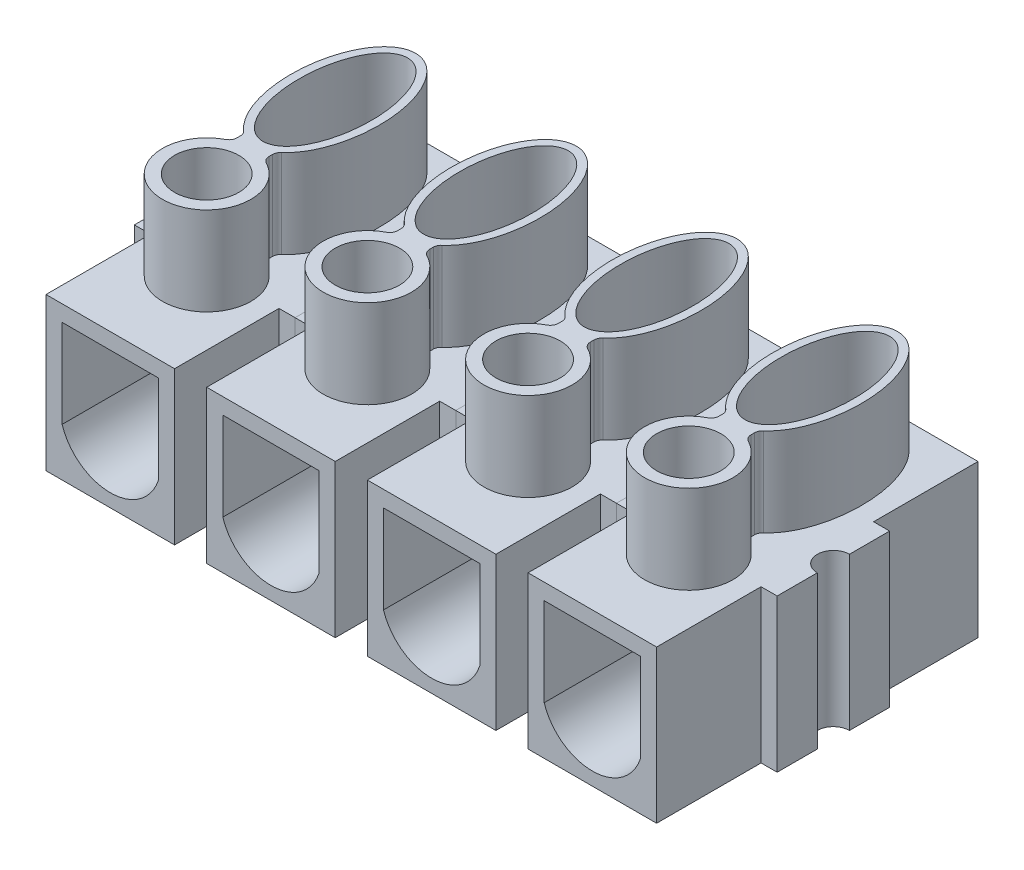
from build123d import *

# Parameters (mm, degrees)
ESQUISSE1_W                = 8
ESQUISSE1_H                = 9.5
EXTRUSION1_DEPTH           = 10
ESQUISSE2_W                = 7
ESQUISSE2_H                = 9.5
EXTRUSION2_DEPTH           = 1
ENL_V_MAT_EXTRU_1_DEPTH    = 15.671400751
ESQUISSE4_R                = 2
ENL_V_MAT_EXTRU_2_DEPTH    = 3
EXTRUSION3_START           = 5.5
ESQUISSE5_R                = 2.75
ESQUISSE5_R_2              = 2
EXTRUSION3_DEPTH           = 5.5
ESQUISSE6_RX               = 5
ESQUISSE6_RY               = 2.75
ESQUISSE6_RX_2             = 4.5
ESQUISSE6_RY_2             = 2.25
EXTRUSION4_DEPTH           = 5.5
EXTRUSION5_START           = 0.5
ESQUISSE7_W                = 2
ESQUISSE7_H                = 5.5
EXTRUSION5_DEPTH           = 1
CONG_1_R                   = 0.5
R_P_TITION_LIN_AIRE3_COUNT = 4
R_P_TITION_LIN_AIRE3_PITCH = 10


with BuildPart() as part:
    # Esquisse1 → Extrusion1 (new, symmetric)
    with BuildSketch(Plane.XY):
        with Locations((0, -4.75)):
            Rectangle(ESQUISSE1_W, ESQUISSE1_H)
        with BuildLine():
            Line((-2.997406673, -1), (3, -1))
            Line((3, -1), (3, -6.5))
            ThreePointArc((3, -6.5), (0.001296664, -8.685490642), (-2.997406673, -6.5))
            Line((-2.997406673, -6.5), (-2.997406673, -1))
        make_face(mode=Mode.SUBTRACT)
    extrude(amount=EXTRUSION1_DEPTH, both=True)

    # Esquisse2 → Extrusion2 (add)
    with BuildSketch(Plane(origin=(4, 0, 0), x_dir=(0, 0, -1), z_dir=(1, 0, 0))):
        with Locations((0, -4.75)):
            Rectangle(ESQUISSE2_W, ESQUISSE2_H)
    extrusion2 = extrude(amount=EXTRUSION2_DEPTH)

    # Sym_trie1: Extrusion2 across plane
    add(extrusion2.mirror(Plane(origin=(0, 0, 0), x_dir=(0, 0, 1), z_dir=(1, 0, 0))))

    # Esquisse3 → Enl_v. mat.-Extru.1 (cut, through all)
    with BuildSketch(Plane(origin=(0, 0, 0), x_dir=(-1, 0, 0), z_dir=(0, 1, 0))):
        with BuildLine():
            Line((-5, 1), (-5, -1))
            ThreePointArc((-5, -1), (-4, 0), (-5, 1))
        make_face()
        with BuildLine():
            Line((5, 1), (5, -1))
            ThreePointArc((5, -1), (4, 0), (5, 1))
        make_face()
    extrude(amount=-ENL_V_MAT_EXTRU_1_DEPTH, mode=Mode.SUBTRACT)

    # Esquisse4 → Enl_v. mat.-Extru.2 (cut)
    with BuildSketch(Plane(origin=(0, 0, 0), x_dir=(-1, 0, 0), z_dir=(0, 1, 0))):
        with Locations(Location((0, 4, 0), (0, 0, 90))):
            Circle(ESQUISSE4_R)
        with Locations(Location((0, -4, 0), (0, 0, 90))):
            Circle(ESQUISSE4_R)
    extrude(amount=-ENL_V_MAT_EXTRU_2_DEPTH, mode=Mode.SUBTRACT)

    # Esquisse5 → Extrusion3 (add)
    with BuildSketch(Plane(origin=(0, 0, 0), x_dir=(-1, 0, 0), z_dir=(0, 1, 0)).offset(EXTRUSION3_START)):
        with Locations(Location((0, 4, 0), (0, 0, 270))):
            Circle(ESQUISSE5_R)
        with Locations(Location((0, 4, 0), (0, 0, 90))):
            Circle(ESQUISSE5_R_2, mode=Mode.SUBTRACT)
    extrude(amount=-EXTRUSION3_DEPTH)

    # Esquisse6 → Extrusion4 (add)
    with BuildSketch(Plane(origin=(0, 0, 0), x_dir=(-1, 0, 0), z_dir=(0, 1, 0))):
        with Locations(Location((0, -4), (0, 0, -90))):
            Ellipse(ESQUISSE6_RX, ESQUISSE6_RY)
        with Locations(Location((0, -4), (0, 0, -90))):
            Ellipse(ESQUISSE6_RX_2, ESQUISSE6_RY_2, mode=Mode.SUBTRACT)
    extrude(amount=EXTRUSION4_DEPTH)

    # Esquisse7 → Extrusion5 (add)
    with BuildSketch(Plane.XY.offset(EXTRUSION5_START)):
        with Locations((0, 2.75)):
            Rectangle(ESQUISSE7_W, ESQUISSE7_H)
    extrude(amount=EXTRUSION5_DEPTH)

    # Cong_1
    cong_1_edges = [part.edges().sort_by_distance(p)[0] for p in [
        (1, 2.75, 0.657704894),
        (-1, 2.75, 0.657704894),
        (-1, 2.75, 1.438262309),
        (1, 2.75, 1.438262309),
    ]]
    fillet(cong_1_edges, radius=CONG_1_R)


with BuildPart() as r_p_tition_lin_aire3_1:
    # R_p_tition lin_aire3: pattern copy
    add(part.part.moved(Location(Vector(1, 0, 0) * (1 * R_P_TITION_LIN_AIRE3_PITCH))))


with BuildPart() as r_p_tition_lin_aire3_2:
    # R_p_tition lin_aire3: pattern copy
    add(part.part.moved(Location(Vector(1, 0, 0) * (2 * R_P_TITION_LIN_AIRE3_PITCH))))


with BuildPart() as r_p_tition_lin_aire3_3:
    # R_p_tition lin_aire3: pattern copy
    add(part.part.moved(Location(Vector(1, 0, 0) * (3 * R_P_TITION_LIN_AIRE3_PITCH))))


solid = Compound([part.part, r_p_tition_lin_aire3_1.part, r_p_tition_lin_aire3_2.part, r_p_tition_lin_aire3_3.part])
